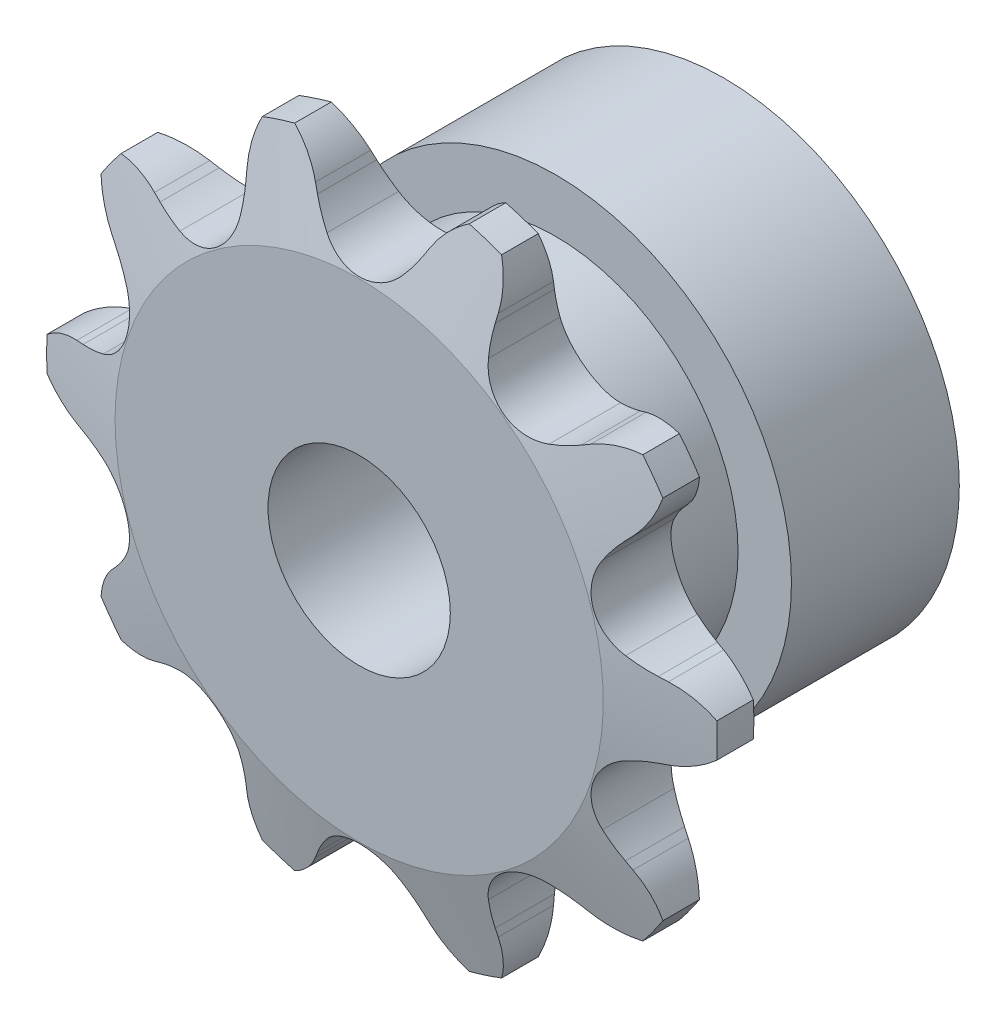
from build123d import *

# Parameters (mm, degrees)
TOOTH_CUT_NUMBER_OF_TEETH_10_DEPTH = 25.862719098
TOOTH_PATTERN_10_10_COUNT          = 10
CUT_EXTRUDE1_DEPTH                 = 30.639540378
CUT_EXTRUDE1_DEPTH_BACK            = 30.639540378
SKETCH4_R                          = 4.7625


with BuildPart() as part:
    # Sprocket-BaseSketch → 35 _06C_ ANSI _ISO_ Chain Number_ 1.214i (revolve)
    with BuildSketch(Plane(origin=(0, 0, 0), x_dir=(0, 0, -1), z_dir=(1, 0, 0)), mode=Mode.PRIVATE) as f_35_06c_ansi_iso_chain_number_1_214i_sk:
        Polygon((2.1463, 0), (2.1463, 12.752467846), (0.955675, 17.514967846), (-0.955675, 17.514967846), (-2.1463, 12.752467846), (-2.1463, 0), align=None)
    revolve(f_35_06c_ansi_iso_chain_number_1_214i_sk.sketch.rotate(Axis((0, 0, -8.5852), (0, 0, 1)), 90), axis=Axis((0, 0, -8.5852), (0, 0, 1)))

    # Tooth-Sketch → Tooth-Cut_ Number of teeth_ 10 (cut, symmetric)
    with BuildSketch(Plane.XY):
        with BuildLine():
            Line((2.775661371, 14.89239906), (2.984168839, 15.274828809))
            ThreePointArc((2.984168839, 15.274828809), (4.56601017, 16.915736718), (6.763913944, 17.519077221))
            ThreePointArc((6.763913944, 17.519077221), (0, 18.779472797), (-6.763913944, 17.519077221))
            ThreePointArc((-6.763913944, 17.519077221), (-4.56601017, 16.915736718), (-2.984168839, 15.274828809))
            Line((-2.984168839, 15.274828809), (-2.775661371, 14.89239906))
            ThreePointArc((-2.775661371, 14.89239906), (-2.397444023, 14.280012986), (-1.95530158, 13.712056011))
            ThreePointArc((-1.95530158, 13.712056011), (0, 12.820973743), (1.95530158, 13.712056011))
            ThreePointArc((1.95530158, 13.712056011), (2.397444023, 14.280012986), (2.775661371, 14.89239906))
        make_face()
    tooth_cut_number_of_teeth_10 = extrude(amount=TOOTH_CUT_NUMBER_OF_TEETH_10_DEPTH, both=True, mode=Mode.SUBTRACT)

    # Tooth Pattern_ 10 _ 10: Tooth-Cut_ Number of teeth_ 10 ×10 about axis
    tooth_pattern_10_10_axis = Axis((0, 0, 0), (0, 0, 1))
    for i in range(1, TOOTH_PATTERN_10_10_COUNT):
        add(tooth_cut_number_of_teeth_10.rotate(tooth_pattern_10_10_axis, i * 360 / TOOTH_PATTERN_10_10_COUNT), mode=Mode.SUBTRACT)

    # Sketch3 → Hub-Revolve1 (revolve)
    with BuildSketch(Plane(origin=(0, 0, 0), x_dir=(0, 0, -1), z_dir=(1, 0, 0)), mode=Mode.PRIVATE) as hub_revolve1_sk:
        Polygon((2.1463, 0), (2.1463, 9.513967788), (8.134350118, 9.513967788), (8.134350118, 12.303760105), (16.9037, 12.303760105), (16.9037, 0), align=None)
    revolve(hub_revolve1_sk.sketch.rotate(Axis((0, 0, 14.7574), (0, 0, -1)), 90), axis=Axis((0, 0, 14.7574), (0, 0, -1)))

    # Sketch4 → Cut-Extrude1 (cut, two sides: drawn at the far end of the back side and taken through both)
    with BuildSketch(Plane.XY.offset(-CUT_EXTRUDE1_DEPTH_BACK)):
        Circle(SKETCH4_R)
    extrude(amount=CUT_EXTRUDE1_DEPTH + CUT_EXTRUDE1_DEPTH_BACK, mode=Mode.SUBTRACT)


solid = part.part
